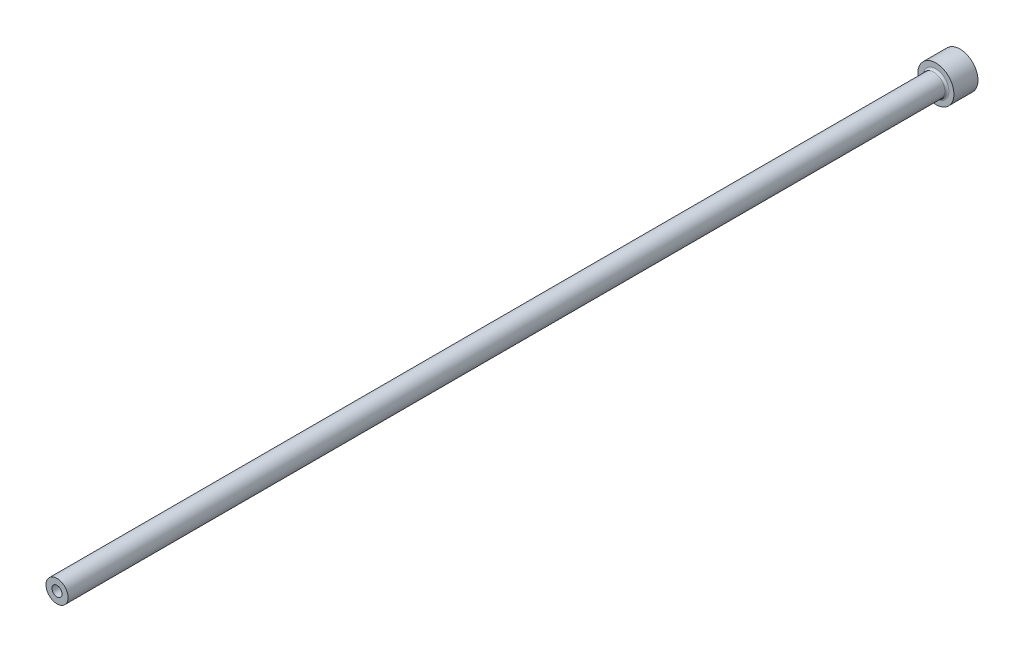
ISO-10303-21;
HEADER;
FILE_DESCRIPTION(('STEP AP214'),'2;1');
FILE_NAME('part.step','',(''),(''),'','','');
FILE_SCHEMA(('AUTOMOTIVE_DESIGN { 1 0 10303 214 1 1 1 1 }'));
ENDSEC;
DATA;
#1=APPLICATION_CONTEXT('core data for automotive mechanical design processes');
#2=APPLICATION_PROTOCOL_DEFINITION('international standard','automotive_design',2000,#1);
#3=PRODUCT_CONTEXT('',#1,'mechanical');
#4=PRODUCT('Part','Part','',(#3));
#5=PRODUCT_RELATED_PRODUCT_CATEGORY('part','',(#4));
#6=PRODUCT_DEFINITION_FORMATION('','',#4);
#7=PRODUCT_DEFINITION_CONTEXT('part definition',#1,'design');
#8=PRODUCT_DEFINITION('design','',#6,#7);
#9=PRODUCT_DEFINITION_SHAPE('','',#8);
#10=(LENGTH_UNIT() NAMED_UNIT(*) SI_UNIT(.MILLI.,.METRE.));
#11=(NAMED_UNIT(*) PLANE_ANGLE_UNIT() SI_UNIT($,.RADIAN.));
#12=(NAMED_UNIT(*) SI_UNIT($,.STERADIAN.) SOLID_ANGLE_UNIT());
#13=UNCERTAINTY_MEASURE_WITH_UNIT(LENGTH_MEASURE(1.E-05),#10,'distance_accuracy_value','');
#14=(GEOMETRIC_REPRESENTATION_CONTEXT(3) GLOBAL_UNCERTAINTY_ASSIGNED_CONTEXT((#13)) GLOBAL_UNIT_ASSIGNED_CONTEXT((#10,
#11,#12)) REPRESENTATION_CONTEXT('',''));
#15=CARTESIAN_POINT('',(0.,0.,0.));
#16=DIRECTION('',(0.,0.,1.));
#17=DIRECTION('',(1.,0.,0.));
#18=AXIS2_PLACEMENT_3D('',#15,#16,#17);
#19=CARTESIAN_POINT('',(0.,0.,225.));
#20=DIRECTION('',(0.,0.,-1.));
#21=DIRECTION('',(-1.,0.,0.));
#22=AXIS2_PLACEMENT_3D('',#19,#20,#21);
#23=PLANE('',#22);
#24=CARTESIAN_POINT('',(0.,0.,225.));
#25=DIRECTION('',(0.,0.,1.));
#26=DIRECTION('',(1.,0.,0.));
#27=AXIS2_PLACEMENT_3D('',#24,#25,#26);
#28=CIRCLE('',#27,1.24999999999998);
#29=CARTESIAN_POINT('',(1.24999999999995,0.,225.));
#30=VERTEX_POINT('',#29);
#31=EDGE_CURVE('E63',#30,#30,#28,.T.);
#32=ORIENTED_EDGE('',*,*,#31,.F.);
#33=EDGE_LOOP('',(#32));
#34=FACE_BOUND('',#33,.T.);
#35=CARTESIAN_POINT('',(0.,0.,225.));
#36=DIRECTION('',(0.,0.,1.));
#37=DIRECTION('',(1.,0.,0.));
#38=AXIS2_PLACEMENT_3D('',#35,#36,#37);
#39=CIRCLE('',#38,2.74999999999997);
#40=CARTESIAN_POINT('',(2.74999999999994,0.,225.));
#41=VERTEX_POINT('',#40);
#42=EDGE_CURVE('E54',#41,#41,#39,.T.);
#43=ORIENTED_EDGE('',*,*,#42,.T.);
#44=EDGE_LOOP('',(#43));
#45=FACE_BOUND('',#44,.T.);
#46=ADVANCED_FACE('F34',(#34,#45),#23,.F.);
#47=CARTESIAN_POINT('',(0.,0.,225.));
#48=DIRECTION('',(0.,0.,1.));
#49=DIRECTION('',(1.,0.,0.));
#50=AXIS2_PLACEMENT_3D('',#47,#48,#49);
#51=CYLINDRICAL_SURFACE('',#50,2.74999999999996);
#52=CARTESIAN_POINT('',(0.,0.,6.50000000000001));
#53=DIRECTION('',(0.,0.,1.));
#54=DIRECTION('',(1.,0.,0.));
#55=AXIS2_PLACEMENT_3D('',#52,#53,#54);
#56=CIRCLE('',#55,2.74999999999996);
#57=CARTESIAN_POINT('',(2.74999999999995,0.,6.50000000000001));
#58=VERTEX_POINT('',#57);
#59=EDGE_CURVE('E49',#58,#58,#56,.T.);
#60=ORIENTED_EDGE('',*,*,#59,.T.);
#61=EDGE_LOOP('',(#60));
#62=FACE_BOUND('',#61,.T.);
#63=ORIENTED_EDGE('',*,*,#42,.F.);
#64=EDGE_LOOP('',(#63));
#65=FACE_BOUND('',#64,.T.);
#66=ADVANCED_FACE('F92',(#62,#65),#51,.T.);
#67=CARTESIAN_POINT('',(0.,0.,6.));
#68=DIRECTION('',(0.,0.,1.));
#69=DIRECTION('',(1.,0.,0.));
#70=AXIS2_PLACEMENT_3D('',#67,#68,#69);
#71=PLANE('',#70);
#72=CARTESIAN_POINT('',(0.,0.,6.));
#73=DIRECTION('',(0.,0.,1.));
#74=DIRECTION('',(1.,0.,0.));
#75=AXIS2_PLACEMENT_3D('',#72,#73,#74);
#76=CIRCLE('',#75,3.24999999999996);
#77=CARTESIAN_POINT('',(3.24999999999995,0.,6.));
#78=VERTEX_POINT('',#77);
#79=EDGE_CURVE('E45',#78,#78,#76,.F.);
#80=ORIENTED_EDGE('',*,*,#79,.T.);
#81=EDGE_LOOP('',(#80));
#82=FACE_BOUND('',#81,.T.);
#83=CARTESIAN_POINT('',(0.,0.,6.00000000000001));
#84=DIRECTION('',(0.,0.,1.));
#85=DIRECTION('',(1.,0.,0.));
#86=AXIS2_PLACEMENT_3D('',#83,#84,#85);
#87=CIRCLE('',#86,4.49999999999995);
#88=CARTESIAN_POINT('',(4.49999999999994,0.,6.00000000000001));
#89=VERTEX_POINT('',#88);
#90=EDGE_CURVE('E57',#89,#89,#87,.T.);
#91=ORIENTED_EDGE('',*,*,#90,.T.);
#92=EDGE_LOOP('',(#91));
#93=FACE_BOUND('',#92,.T.);
#94=ADVANCED_FACE('F98',(#82,#93),#71,.T.);
#95=CARTESIAN_POINT('',(0.,0.,225.));
#96=DIRECTION('',(0.,0.,1.));
#97=DIRECTION('',(1.,0.,0.));
#98=AXIS2_PLACEMENT_3D('',#95,#96,#97);
#99=CYLINDRICAL_SURFACE('',#98,4.49999999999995);
#100=ORIENTED_EDGE('',*,*,#90,.F.);
#101=EDGE_LOOP('',(#100));
#102=FACE_BOUND('',#101,.T.);
#103=CARTESIAN_POINT('',(0.,0.,0.));
#104=DIRECTION('',(0.,0.,1.));
#105=DIRECTION('',(1.,0.,0.));
#106=AXIS2_PLACEMENT_3D('',#103,#104,#105);
#107=CIRCLE('',#106,4.49999999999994);
#108=CARTESIAN_POINT('',(4.49999999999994,0.,0.));
#109=VERTEX_POINT('',#108);
#110=EDGE_CURVE('E60',#109,#109,#107,.T.);
#111=ORIENTED_EDGE('',*,*,#110,.T.);
#112=EDGE_LOOP('',(#111));
#113=FACE_BOUND('',#112,.T.);
#114=ADVANCED_FACE('F89',(#102,#113),#99,.T.);
#115=CARTESIAN_POINT('',(0.,0.,0.));
#116=DIRECTION('',(0.,0.,1.));
#117=DIRECTION('',(1.,0.,0.));
#118=AXIS2_PLACEMENT_3D('',#115,#116,#117);
#119=PLANE('',#118);
#120=CARTESIAN_POINT('',(0.,0.,0.));
#121=DIRECTION('',(0.,0.,1.));
#122=DIRECTION('',(1.,0.,0.));
#123=AXIS2_PLACEMENT_3D('',#120,#121,#122);
#124=CIRCLE('',#123,1.99999999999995);
#125=CARTESIAN_POINT('',(1.99999999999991,0.,0.));
#126=VERTEX_POINT('',#125);
#127=EDGE_CURVE('E41',#126,#126,#124,.T.);
#128=ORIENTED_EDGE('',*,*,#127,.T.);
#129=EDGE_LOOP('',(#128));
#130=FACE_BOUND('',#129,.T.);
#131=ORIENTED_EDGE('',*,*,#110,.F.);
#132=EDGE_LOOP('',(#131));
#133=FACE_BOUND('',#132,.T.);
#134=ADVANCED_FACE('F83',(#130,#133),#119,.F.);
#135=CARTESIAN_POINT('',(0.,0.,225.));
#136=DIRECTION('',(0.,0.,1.));
#137=DIRECTION('',(1.,0.,0.));
#138=AXIS2_PLACEMENT_3D('',#135,#136,#137);
#139=CYLINDRICAL_SURFACE('',#138,1.24999999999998);
#140=ORIENTED_EDGE('',*,*,#31,.T.);
#141=EDGE_LOOP('',(#140));
#142=FACE_BOUND('',#141,.T.);
#143=CARTESIAN_POINT('',(0.,0.,125.));
#144=DIRECTION('',(0.,0.,1.));
#145=DIRECTION('',(1.,0.,0.));
#146=AXIS2_PLACEMENT_3D('',#143,#144,#145);
#147=CIRCLE('',#146,1.24999999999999);
#148=CARTESIAN_POINT('',(1.24999999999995,0.,125.));
#149=VERTEX_POINT('',#148);
#150=EDGE_CURVE('E66',#149,#149,#147,.T.);
#151=ORIENTED_EDGE('',*,*,#150,.F.);
#152=EDGE_LOOP('',(#151));
#153=FACE_BOUND('',#152,.T.);
#154=ADVANCED_FACE('F78',(#142,#153),#139,.F.);
#155=CARTESIAN_POINT('',(0.,0.,125.));
#156=DIRECTION('',(0.,0.,-1.));
#157=DIRECTION('',(-1.,0.,0.));
#158=AXIS2_PLACEMENT_3D('',#155,#156,#157);
#159=CONICAL_SURFACE('',#158,1.24999999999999,0.523598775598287);
#160=CARTESIAN_POINT('',(0.,0.,124.566987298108));
#161=DIRECTION('',(0.,0.,1.));
#162=DIRECTION('',(1.,0.,0.));
#163=AXIS2_PLACEMENT_3D('',#160,#161,#162);
#164=CIRCLE('',#163,1.49999999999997);
#165=CARTESIAN_POINT('',(1.49999999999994,0.,124.566987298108));
#166=VERTEX_POINT('',#165);
#167=EDGE_CURVE('E69',#166,#166,#164,.T.);
#168=ORIENTED_EDGE('',*,*,#167,.F.);
#169=EDGE_LOOP('',(#168));
#170=FACE_BOUND('',#169,.T.);
#171=ORIENTED_EDGE('',*,*,#150,.T.);
#172=EDGE_LOOP('',(#171));
#173=FACE_BOUND('',#172,.T.);
#174=ADVANCED_FACE('F75',(#170,#173),#159,.F.);
#175=CARTESIAN_POINT('',(0.,0.,225.));
#176=DIRECTION('',(0.,0.,1.));
#177=DIRECTION('',(1.,0.,0.));
#178=AXIS2_PLACEMENT_3D('',#175,#176,#177);
#179=CYLINDRICAL_SURFACE('',#178,1.49999999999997);
#180=CARTESIAN_POINT('',(0.,0.,0.499999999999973));
#181=DIRECTION('',(0.,0.,1.));
#182=DIRECTION('',(1.,0.,0.));
#183=AXIS2_PLACEMENT_3D('',#180,#181,#182);
#184=CIRCLE('',#183,1.49999999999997);
#185=CARTESIAN_POINT('',(1.49999999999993,0.,0.499999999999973));
#186=VERTEX_POINT('',#185);
#187=EDGE_CURVE('E10',#186,#186,#184,.F.);
#188=ORIENTED_EDGE('',*,*,#187,.T.);
#189=EDGE_LOOP('',(#188));
#190=FACE_BOUND('',#189,.T.);
#191=ORIENTED_EDGE('',*,*,#167,.T.);
#192=EDGE_LOOP('',(#191));
#193=FACE_BOUND('',#192,.T.);
#194=ADVANCED_FACE('F73',(#190,#193),#179,.F.);
#195=CARTESIAN_POINT('',(0.,0.,6.50000000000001));
#196=DIRECTION('',(0.,0.,1.));
#197=DIRECTION('',(1.,0.,0.));
#198=AXIS2_PLACEMENT_3D('',#195,#196,#197);
#199=TOROIDAL_SURFACE('',#198,3.24999999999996,0.5);
#200=ORIENTED_EDGE('',*,*,#79,.F.);
#201=EDGE_LOOP('',(#200));
#202=FACE_BOUND('',#201,.T.);
#203=ORIENTED_EDGE('',*,*,#59,.F.);
#204=EDGE_LOOP('',(#203));
#205=FACE_BOUND('',#204,.T.);
#206=ADVANCED_FACE('F104',(#202,#205),#199,.F.);
#207=CARTESIAN_POINT('',(0.,0.,0.));
#208=DIRECTION('',(0.,0.,-1.));
#209=DIRECTION('',(-1.,0.,0.));
#210=AXIS2_PLACEMENT_3D('',#207,#208,#209);
#211=CONICAL_SURFACE('',#210,1.99999999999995,0.785398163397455);
#212=ORIENTED_EDGE('',*,*,#187,.F.);
#213=EDGE_LOOP('',(#212));
#214=FACE_BOUND('',#213,.T.);
#215=ORIENTED_EDGE('',*,*,#127,.F.);
#216=EDGE_LOOP('',(#215));
#217=FACE_BOUND('',#216,.T.);
#218=ADVANCED_FACE('F36',(#214,#217),#211,.F.);
#219=CLOSED_SHELL('',(#46,#66,#94,#114,#134,#154,#174,#194,#206,#218));
#220=MANIFOLD_SOLID_BREP('B2',#219);
#221=ADVANCED_BREP_SHAPE_REPRESENTATION('',(#18,#220),#14);
#222=SHAPE_DEFINITION_REPRESENTATION(#9,#221);
ENDSEC;
END-ISO-10303-21;
